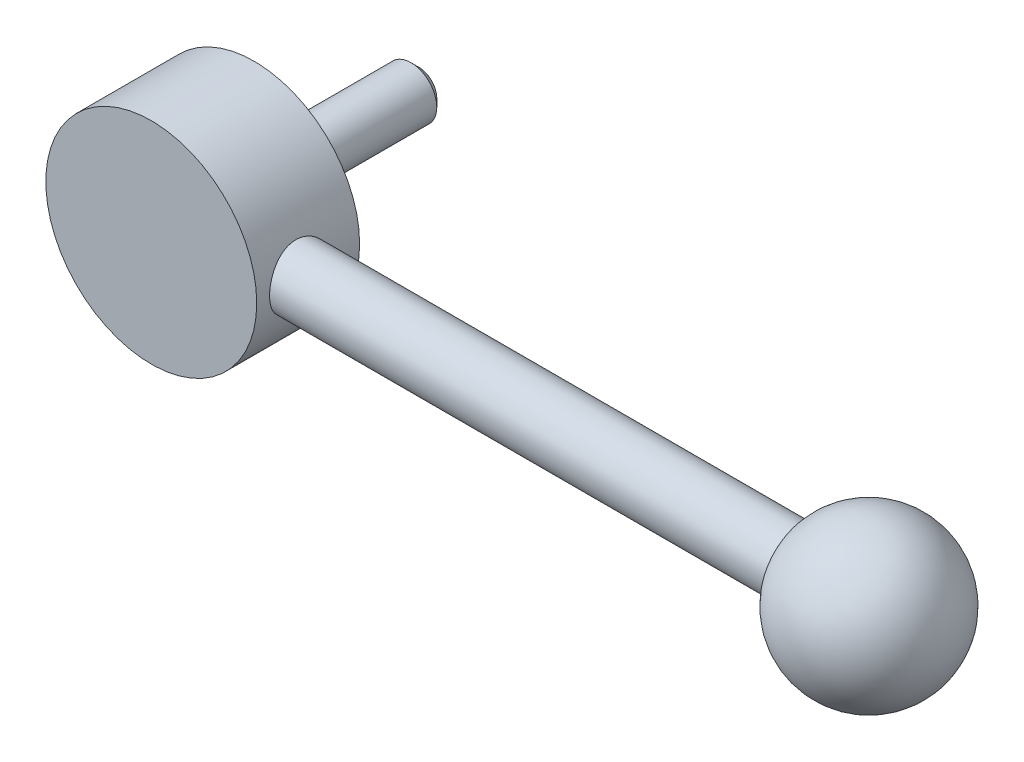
ISO-10303-21;
HEADER;
FILE_DESCRIPTION(('STEP AP214'),'2;1');
FILE_NAME('part.step','',(''),(''),'','','');
FILE_SCHEMA(('AUTOMOTIVE_DESIGN { 1 0 10303 214 1 1 1 1 }'));
ENDSEC;
DATA;
#1=APPLICATION_CONTEXT('core data for automotive mechanical design processes');
#2=APPLICATION_PROTOCOL_DEFINITION('international standard','automotive_design',2000,#1);
#3=PRODUCT_CONTEXT('',#1,'mechanical');
#4=PRODUCT('Part','Part','',(#3));
#5=PRODUCT_RELATED_PRODUCT_CATEGORY('part','',(#4));
#6=PRODUCT_DEFINITION_FORMATION('','',#4);
#7=PRODUCT_DEFINITION_CONTEXT('part definition',#1,'design');
#8=PRODUCT_DEFINITION('design','',#6,#7);
#9=PRODUCT_DEFINITION_SHAPE('','',#8);
#10=(LENGTH_UNIT() NAMED_UNIT(*) SI_UNIT(.MILLI.,.METRE.));
#11=(NAMED_UNIT(*) PLANE_ANGLE_UNIT() SI_UNIT($,.RADIAN.));
#12=(NAMED_UNIT(*) SI_UNIT($,.STERADIAN.) SOLID_ANGLE_UNIT());
#13=UNCERTAINTY_MEASURE_WITH_UNIT(LENGTH_MEASURE(1.E-05),#10,'distance_accuracy_value','');
#14=(GEOMETRIC_REPRESENTATION_CONTEXT(3) GLOBAL_UNCERTAINTY_ASSIGNED_CONTEXT((#13)) GLOBAL_UNIT_ASSIGNED_CONTEXT((#10,
#11,#12)) REPRESENTATION_CONTEXT('',''));
#15=CARTESIAN_POINT('',(0.,0.,0.));
#16=DIRECTION('',(0.,0.,1.));
#17=DIRECTION('',(1.,0.,0.));
#18=AXIS2_PLACEMENT_3D('',#15,#16,#17);
#19=CARTESIAN_POINT('',(0.,0.,40.));
#20=DIRECTION('',(0.,0.,1.));
#21=DIRECTION('',(1.,0.,0.));
#22=AXIS2_PLACEMENT_3D('',#19,#20,#21);
#23=CYLINDRICAL_SURFACE('',#22,9.5);
#24=CARTESIAN_POINT('',(0.,0.,2.));
#25=DIRECTION('',(0.,0.,1.));
#26=DIRECTION('',(1.,0.,0.));
#27=AXIS2_PLACEMENT_3D('',#24,#25,#26);
#28=CIRCLE('',#27,9.5);
#29=CARTESIAN_POINT('',(9.5,0.,2.));
#30=VERTEX_POINT('',#29);
#31=EDGE_CURVE('E37',#30,#30,#28,.T.);
#32=ORIENTED_EDGE('',*,*,#31,.F.);
#33=EDGE_LOOP('',(#32));
#34=FACE_BOUND('',#33,.T.);
#35=CARTESIAN_POINT('',(0.,0.,0.));
#36=DIRECTION('',(0.,0.,1.));
#37=DIRECTION('',(1.,0.,0.));
#38=AXIS2_PLACEMENT_3D('',#35,#36,#37);
#39=CIRCLE('',#38,9.5);
#40=CARTESIAN_POINT('',(9.5,0.,0.));
#41=VERTEX_POINT('',#40);
#42=EDGE_CURVE('E23',#41,#41,#39,.T.);
#43=ORIENTED_EDGE('',*,*,#42,.T.);
#44=EDGE_LOOP('',(#43));
#45=FACE_BOUND('',#44,.T.);
#46=ADVANCED_FACE('F12',(#34,#45),#23,.T.);
#47=CARTESIAN_POINT('',(5.,0.,0.));
#48=DIRECTION('',(0.,0.,1.));
#49=DIRECTION('',(1.,0.,0.));
#50=AXIS2_PLACEMENT_3D('',#47,#48,#49);
#51=PLANE('',#50);
#52=ORIENTED_EDGE('',*,*,#42,.F.);
#53=EDGE_LOOP('',(#52));
#54=FACE_BOUND('',#53,.T.);
#55=CARTESIAN_POINT('',(0.,0.,0.));
#56=DIRECTION('',(0.,0.,1.));
#57=DIRECTION('',(1.,0.,0.));
#58=AXIS2_PLACEMENT_3D('',#55,#56,#57);
#59=CIRCLE('',#58,5.);
#60=CARTESIAN_POINT('',(5.,0.,0.));
#61=VERTEX_POINT('',#60);
#62=EDGE_CURVE('E27',#61,#61,#59,.T.);
#63=ORIENTED_EDGE('',*,*,#62,.T.);
#64=EDGE_LOOP('',(#63));
#65=FACE_BOUND('',#64,.T.);
#66=ADVANCED_FACE('F63',(#54,#65),#51,.F.);
#67=CARTESIAN_POINT('',(0.,0.,40.));
#68=DIRECTION('',(0.,0.,1.));
#69=DIRECTION('',(1.,0.,0.));
#70=AXIS2_PLACEMENT_3D('',#67,#68,#69);
#71=CYLINDRICAL_SURFACE('',#70,5.);
#72=CARTESIAN_POINT('',(0.,0.,-28.5));
#73=DIRECTION('',(0.,0.,-1.));
#74=DIRECTION('',(-1.,0.,0.));
#75=AXIS2_PLACEMENT_3D('',#72,#73,#74);
#76=CIRCLE('',#75,5.);
#77=CARTESIAN_POINT('',(-5.,0.,-28.5));
#78=VERTEX_POINT('',#77);
#79=EDGE_CURVE('E19',#78,#78,#76,.F.);
#80=ORIENTED_EDGE('',*,*,#79,.T.);
#81=EDGE_LOOP('',(#80));
#82=FACE_BOUND('',#81,.T.);
#83=ORIENTED_EDGE('',*,*,#62,.F.);
#84=EDGE_LOOP('',(#83));
#85=FACE_BOUND('',#84,.T.);
#86=ADVANCED_FACE('F69',(#82,#85),#71,.T.);
#87=CARTESIAN_POINT('',(5.,0.,-30.));
#88=DIRECTION('',(0.,0.,-1.));
#89=DIRECTION('',(-1.,0.,0.));
#90=AXIS2_PLACEMENT_3D('',#87,#88,#89);
#91=PLANE('',#90);
#92=CARTESIAN_POINT('',(0.,0.,-30.));
#93=DIRECTION('',(0.,0.,-1.));
#94=DIRECTION('',(-1.,0.,0.));
#95=AXIS2_PLACEMENT_3D('',#92,#93,#94);
#96=CIRCLE('',#95,3.5);
#97=CARTESIAN_POINT('',(-3.5,0.,-30.));
#98=VERTEX_POINT('',#97);
#99=EDGE_CURVE('E8',#98,#98,#96,.T.);
#100=ORIENTED_EDGE('',*,*,#99,.T.);
#101=EDGE_LOOP('',(#100));
#102=FACE_BOUND('',#101,.T.);
#103=ADVANCED_FACE('F77',(#102),#91,.T.);
#104=CARTESIAN_POINT('',(20.5,0.,22.));
#105=DIRECTION('',(0.,0.,-1.));
#106=DIRECTION('',(-1.,0.,0.));
#107=AXIS2_PLACEMENT_3D('',#104,#105,#106);
#108=PLANE('',#107);
#109=CARTESIAN_POINT('',(0.,0.,22.));
#110=DIRECTION('',(0.,0.,1.));
#111=DIRECTION('',(1.,0.,0.));
#112=AXIS2_PLACEMENT_3D('',#109,#110,#111);
#113=CIRCLE('',#112,20.5);
#114=CARTESIAN_POINT('',(20.5,0.,22.));
#115=VERTEX_POINT('',#114);
#116=EDGE_CURVE('E86',#115,#115,#113,.T.);
#117=ORIENTED_EDGE('',*,*,#116,.T.);
#118=EDGE_LOOP('',(#117));
#119=FACE_BOUND('',#118,.T.);
#120=ADVANCED_FACE('F58',(#119),#108,.F.);
#121=CARTESIAN_POINT('',(0.,0.,40.));
#122=DIRECTION('',(0.,0.,1.));
#123=DIRECTION('',(1.,0.,0.));
#124=AXIS2_PLACEMENT_3D('',#121,#122,#123);
#125=CYLINDRICAL_SURFACE('',#124,20.5);
#126=CARTESIAN_POINT('',(20.5,0.,7.5));
#127=CARTESIAN_POINT('',(20.4999997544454,-0.164768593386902,7.50000038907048));
#128=CARTESIAN_POINT('',(20.4980087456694,-0.329544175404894,7.50679278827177));
#129=CARTESIAN_POINT('',(20.4900990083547,-0.65788822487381,7.5339021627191));
#130=CARTESIAN_POINT('',(20.4841800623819,-0.821456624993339,7.55421988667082));
#131=CARTESIAN_POINT('',(20.4685766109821,-1.1462122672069,7.60820100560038));
#132=CARTESIAN_POINT('',(20.4588916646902,-1.30739922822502,7.64186596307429));
#133=CARTESIAN_POINT('',(20.4360164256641,-1.62628314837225,7.72226244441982));
#134=CARTESIAN_POINT('',(20.4228249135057,-1.7839788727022,7.76899851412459));
#135=CARTESIAN_POINT('',(20.3933182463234,-2.09448185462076,7.87505403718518));
#136=CARTESIAN_POINT('',(20.3770082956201,-2.24729676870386,7.93435254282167));
#137=CARTESIAN_POINT('',(20.3416823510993,-2.54730770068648,8.06511256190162));
#138=CARTESIAN_POINT('',(20.3226662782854,-2.69450355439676,8.13657443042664));
#139=CARTESIAN_POINT('',(20.2824208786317,-2.98237032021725,8.2911456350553));
#140=CARTESIAN_POINT('',(20.2611910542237,-3.123039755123,8.37425759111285));
#141=CARTESIAN_POINT('',(20.2170775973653,-3.39691169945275,8.55150630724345));
#142=CARTESIAN_POINT('',(20.1941944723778,-3.53011647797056,8.6456396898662));
#143=CARTESIAN_POINT('',(20.146767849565,-3.79154794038,8.84682399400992));
#144=CARTESIAN_POINT('',(20.1221971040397,-3.91956600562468,8.95413966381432));
#145=CARTESIAN_POINT('',(20.0725990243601,-4.1661228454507,9.17897611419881));
#146=CARTESIAN_POINT('',(20.0475718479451,-4.2846648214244,9.29649342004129));
#147=CARTESIAN_POINT('',(19.9977175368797,-4.5116297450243,9.54108035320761));
#148=CARTESIAN_POINT('',(19.9728905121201,-4.62004743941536,9.66815487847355));
#149=CARTESIAN_POINT('',(19.9241410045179,-4.82595045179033,9.93095842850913));
#150=CARTESIAN_POINT('',(19.9002181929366,-4.92343976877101,10.0666842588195));
#151=CARTESIAN_POINT('',(19.8534354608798,-5.10885934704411,10.3490171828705));
#152=CARTESIAN_POINT('',(19.8306098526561,-5.19653638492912,10.4957964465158));
#153=CARTESIAN_POINT('',(19.7872868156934,-5.35913808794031,10.7965125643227));
#154=CARTESIAN_POINT('',(19.766788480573,-5.43406772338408,10.9504465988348));
#155=CARTESIAN_POINT('',(19.7287391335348,-5.57062666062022,11.2645036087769));
#156=CARTESIAN_POINT('',(19.7111887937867,-5.63225293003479,11.4246279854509));
#157=CARTESIAN_POINT('',(19.6796082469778,-5.74162541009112,11.7498143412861));
#158=CARTESIAN_POINT('',(19.6655765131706,-5.78937764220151,11.9148741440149));
#159=CARTESIAN_POINT('',(19.6418018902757,-5.86952471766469,12.2443484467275));
#160=CARTESIAN_POINT('',(19.6319555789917,-5.90229162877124,12.4086649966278));
#161=CARTESIAN_POINT('',(19.6163432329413,-5.95397424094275,12.7395899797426));
#162=CARTESIAN_POINT('',(19.6105755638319,-5.97289549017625,12.9061974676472));
#163=CARTESIAN_POINT('',(19.603301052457,-5.99672775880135,13.2405034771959));
#164=CARTESIAN_POINT('',(19.6017941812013,-6.00163887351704,13.4082019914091));
#165=CARTESIAN_POINT('',(19.6030905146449,-5.99740342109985,13.7434027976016));
#166=CARTESIAN_POINT('',(19.6058936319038,-5.98825713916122,13.9109050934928));
#167=CARTESIAN_POINT('',(19.6155486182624,-5.95655212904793,14.238688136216));
#168=CARTESIAN_POINT('',(19.6222578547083,-5.9344657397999,14.3990190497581));
#169=CARTESIAN_POINT('',(19.6394095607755,-5.87745500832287,14.7172343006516));
#170=CARTESIAN_POINT('',(19.649853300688,-5.84252629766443,14.8751177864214));
#171=CARTESIAN_POINT('',(19.6741615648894,-5.7601395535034,15.187257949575));
#172=CARTESIAN_POINT('',(19.688025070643,-5.71268525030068,15.3415156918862));
#173=CARTESIAN_POINT('',(19.7187796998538,-5.60560692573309,15.6454959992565));
#174=CARTESIAN_POINT('',(19.7356719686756,-5.5459782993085,15.7952168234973));
#175=CARTESIAN_POINT('',(19.7722410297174,-5.41416819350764,16.0910079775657));
#176=CARTESIAN_POINT('',(19.7919506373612,-5.34183608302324,16.2370072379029));
#177=CARTESIAN_POINT('',(19.8334359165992,-5.18568691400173,16.5224423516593));
#178=CARTESIAN_POINT('',(19.8552123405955,-5.10186566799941,16.6618757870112));
#179=CARTESIAN_POINT('',(19.9227548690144,-4.8340177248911,17.0689782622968));
#180=CARTESIAN_POINT('',(19.9707648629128,-4.63350124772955,17.3256854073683));
#181=CARTESIAN_POINT('',(20.0696162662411,-4.18511260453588,17.8126329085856));
#182=CARTESIAN_POINT('',(20.1204944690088,-3.93567819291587,18.0414205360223));
#183=CARTESIAN_POINT('',(20.2176813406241,-3.40132203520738,18.4542852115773));
#184=CARTESIAN_POINT('',(20.2639897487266,-3.11639826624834,18.63835970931));
#185=CARTESIAN_POINT('',(20.3472018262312,-2.51664006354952,18.9573414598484));
#186=CARTESIAN_POINT('',(20.3840462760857,-2.2016334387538,19.0919412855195));
#187=CARTESIAN_POINT('',(20.4437541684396,-1.55212614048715,19.3058343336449));
#188=CARTESIAN_POINT('',(20.4666213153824,-1.21763065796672,19.3851422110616));
#189=CARTESIAN_POINT('',(20.4952175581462,-0.550953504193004,19.4838192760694));
#190=CARTESIAN_POINT('',(20.5015074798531,-0.219085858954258,19.5051506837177));
#191=CARTESIAN_POINT('',(20.4978783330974,0.44350281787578,19.4927506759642));
#192=CARTESIAN_POINT('',(20.4879613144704,0.774223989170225,19.4590262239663));
#193=CARTESIAN_POINT('',(20.4533992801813,1.41781519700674,19.3390673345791));
#194=CARTESIAN_POINT('',(20.4290727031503,1.73091547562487,19.253967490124));
#195=CARTESIAN_POINT('',(20.3684901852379,2.33834273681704,19.0350155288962));
#196=CARTESIAN_POINT('',(20.3322328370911,2.63266749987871,18.901157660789));
#197=CARTESIAN_POINT('',(20.2505580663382,3.201467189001,18.585163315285));
#198=CARTESIAN_POINT('',(20.2049537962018,3.47535043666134,18.4020133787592));
#199=CARTESIAN_POINT('',(20.1098009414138,3.98926947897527,17.9937010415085));
#200=CARTESIAN_POINT('',(20.0602514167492,4.22929716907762,17.7685286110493));
#201=CARTESIAN_POINT('',(19.9860369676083,4.56311282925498,17.3996018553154));
#202=CARTESIAN_POINT('',(19.9608943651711,4.67160496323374,17.2689475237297));
#203=CARTESIAN_POINT('',(19.9116554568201,4.87720494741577,16.9988051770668));
#204=CARTESIAN_POINT('',(19.8875587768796,4.97431688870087,16.8593203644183));
#205=CARTESIAN_POINT('',(19.8411019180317,5.15650338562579,16.5723575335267));
#206=CARTESIAN_POINT('',(19.8187424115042,5.24157329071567,16.4248764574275));
#207=CARTESIAN_POINT('',(19.7764458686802,5.39896546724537,16.1230001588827));
#208=CARTESIAN_POINT('',(19.7565078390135,5.47129297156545,15.9686078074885));
#209=CARTESIAN_POINT('',(19.7197444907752,5.60234699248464,15.6546484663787));
#210=CARTESIAN_POINT('',(19.7029051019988,5.6611353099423,15.49510893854));
#211=CARTESIAN_POINT('',(19.6727610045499,5.76501533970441,15.1713718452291));
#212=CARTESIAN_POINT('',(19.6594548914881,5.81011249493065,15.0071761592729));
#213=CARTESIAN_POINT('',(19.6367999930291,5.88622676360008,14.675294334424));
#214=CARTESIAN_POINT('',(19.6274509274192,5.91724487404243,14.5076084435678));
#215=CARTESIAN_POINT('',(19.6130187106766,5.96490739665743,14.1700260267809));
#216=CARTESIAN_POINT('',(19.6079354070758,5.98155232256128,14.0001295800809));
#217=CARTESIAN_POINT('',(19.6023186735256,5.9999323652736,13.6662567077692));
#218=CARTESIAN_POINT('',(19.6016119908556,6.00223524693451,13.5023141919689));
#219=CARTESIAN_POINT('',(19.6043094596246,5.99341910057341,13.1747666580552));
#220=CARTESIAN_POINT('',(19.6077150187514,5.98229547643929,13.0111617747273));
#221=CARTESIAN_POINT('',(19.6185313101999,5.94672790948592,12.6856110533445));
#222=CARTESIAN_POINT('',(19.6259403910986,5.92228945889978,12.5236645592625));
#223=CARTESIAN_POINT('',(19.6445384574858,5.86030325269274,12.2024601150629));
#224=CARTESIAN_POINT('',(19.6557288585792,5.82275058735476,12.0432031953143));
#225=CARTESIAN_POINT('',(19.6814005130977,5.73537439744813,11.7303823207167));
#226=CARTESIAN_POINT('',(19.6958418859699,5.68569901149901,11.5767736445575));
#227=CARTESIAN_POINT('',(19.7276768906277,5.57423736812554,11.2742707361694));
#228=CARTESIAN_POINT('',(19.7450715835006,5.51244675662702,11.125378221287));
#229=CARTESIAN_POINT('',(19.782319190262,5.37724463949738,10.8333301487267));
#230=CARTESIAN_POINT('',(19.802171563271,5.30383568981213,10.6901733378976));
#231=CARTESIAN_POINT('',(19.8438063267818,5.14587421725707,10.4103722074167));
#232=CARTESIAN_POINT('',(19.8655894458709,5.061317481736,10.2737303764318));
#233=CARTESIAN_POINT('',(19.9112797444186,4.87853600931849,10.0032239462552));
#234=CARTESIAN_POINT('',(19.9352342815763,4.77994030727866,9.86961789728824));
#235=CARTESIAN_POINT('',(19.9839347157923,4.57206196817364,9.61107007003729));
#236=CARTESIAN_POINT('',(20.0086809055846,4.46277534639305,9.48613155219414));
#237=CARTESIAN_POINT('',(20.0582834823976,4.23425660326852,9.24575891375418));
#238=CARTESIAN_POINT('',(20.0831398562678,4.11502564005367,9.13032368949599));
#239=CARTESIAN_POINT('',(20.1323098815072,3.86730499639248,8.90963180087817));
#240=CARTESIAN_POINT('',(20.1566233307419,3.7388119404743,8.80437888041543));
#241=CARTESIAN_POINT('',(20.2046974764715,3.46977987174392,8.6020699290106));
#242=CARTESIAN_POINT('',(20.2284250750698,3.32900807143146,8.50531528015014));
#243=CARTESIAN_POINT('',(20.2739466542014,3.03949915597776,8.32403500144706));
#244=CARTESIAN_POINT('',(20.2957406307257,2.8907620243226,8.23950939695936));
#245=CARTESIAN_POINT('',(20.3367679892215,2.58639447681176,8.0833769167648));
#246=CARTESIAN_POINT('',(20.356002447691,2.43076699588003,8.01176460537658));
#247=CARTESIAN_POINT('',(20.3913677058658,2.11366097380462,7.88201306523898));
#248=CARTESIAN_POINT('',(20.4074988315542,1.95218304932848,7.82387242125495));
#249=CARTESIAN_POINT('',(20.4344672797,1.64423058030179,7.72771145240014));
#250=CARTESIAN_POINT('',(20.4457076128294,1.49828162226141,7.68811373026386));
#251=CARTESIAN_POINT('',(20.4651675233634,1.2036242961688,7.62002138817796));
#252=CARTESIAN_POINT('',(20.4733873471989,1.0549161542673,7.59152586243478));
#253=CARTESIAN_POINT('',(20.4866168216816,0.755624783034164,7.54584620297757));
#254=CARTESIAN_POINT('',(20.491626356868,0.605041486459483,7.52866247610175));
#255=CARTESIAN_POINT('',(20.49831762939,0.302973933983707,7.50574067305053));
#256=CARTESIAN_POINT('',(20.5000002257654,0.151489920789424,7.49999964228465));
#257=CARTESIAN_POINT('',(20.5,0.,7.5));
#258=B_SPLINE_CURVE_WITH_KNOTS('',3,(#126,#127,#128,#129,#130,#131,#132,#133,#134,#135,#136,
#137,#138,#139,#140,#141,#142,#143,#144,#145,#146,#147,#148,#149,#150,#151,#152,#153,#154,#155,
#156,#157,#158,#159,#160,#161,#162,#163,#164,#165,#166,#167,#168,#169,#170,#171,#172,#173,#174,
#175,#176,#177,#178,#179,#180,#181,#182,#183,#184,#185,#186,#187,#188,#189,#190,#191,#192,#193,
#194,#195,#196,#197,#198,#199,#200,#201,#202,#203,#204,#205,#206,#207,#208,#209,#210,#211,#212,
#213,#214,#215,#216,#217,#218,#219,#220,#221,#222,#223,#224,#225,#226,#227,#228,#229,#230,#231,
#232,#233,#234,#235,#236,#237,#238,#239,#240,#241,#242,#243,#244,#245,#246,#247,#248,#249,#250,
#251,#252,#253,#254,#255,#256,#257),.UNSPECIFIED.,.T.,.F.,(4,2,2,2,2,2,2,2,2,2,2,2,2,2,2,2,2,2,
2,2,2,2,2,2,2,2,2,2,2,2,2,2,2,2,2,2,2,2,2,2,2,2,2,2,2,2,2,2,2,2,2,2,2,2,2,2,2,2,2,2,2,2,2,2,2,
4),(0.,0.494166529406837,0.988360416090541,1.48261217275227,1.97703603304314,2.47064184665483,
2.96426207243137,3.45799348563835,3.95157399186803,4.45753270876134,4.96331976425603,
5.46936781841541,5.97523008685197,6.49206535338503,7.00869863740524,7.52544955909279,
8.04197586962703,8.54486934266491,9.04756118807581,9.55024961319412,10.0529278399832,
10.5383093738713,11.0238561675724,11.5092585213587,11.9948448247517,12.4866344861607,
12.9786038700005,13.9617709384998,14.9839152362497,16.006117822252,17.0345689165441,
18.062747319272,19.0556662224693,20.0484595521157,21.0200911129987,21.9918373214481,
22.9853318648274,23.97906383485,24.4935931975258,25.0079370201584,25.5224789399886,
26.0368090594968,26.5487427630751,27.0604726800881,27.5721663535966,28.0838417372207,
28.5751252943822,29.066577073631,29.5578262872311,30.0492596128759,30.5349645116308,
31.0208442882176,31.5066173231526,31.9925744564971,32.4953010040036,32.9982156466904,
33.5010718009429,34.0041121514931,34.5208552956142,35.0375995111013,35.5541256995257,
36.0705976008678,36.525077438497,36.9795201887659,37.4339792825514,37.8883210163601),.UNSPECIFIED.);
#259=CARTESIAN_POINT('',(20.5,0.,7.5));
#260=VERTEX_POINT('',#259);
#261=EDGE_CURVE('E30',#260,#260,#258,.T.);
#262=ORIENTED_EDGE('',*,*,#261,.T.);
#263=EDGE_LOOP('',(#262));
#264=FACE_BOUND('',#263,.T.);
#265=ORIENTED_EDGE('',*,*,#116,.F.);
#266=EDGE_LOOP('',(#265));
#267=FACE_BOUND('',#266,.T.);
#268=CARTESIAN_POINT('',(0.,0.,2.));
#269=DIRECTION('',(0.,0.,1.));
#270=DIRECTION('',(1.,0.,0.));
#271=AXIS2_PLACEMENT_3D('',#268,#269,#270);
#272=CIRCLE('',#271,20.5);
#273=CARTESIAN_POINT('',(20.5,0.,2.));
#274=VERTEX_POINT('',#273);
#275=EDGE_CURVE('E88',#274,#274,#272,.T.);
#276=ORIENTED_EDGE('',*,*,#275,.T.);
#277=EDGE_LOOP('',(#276));
#278=FACE_BOUND('',#277,.T.);
#279=ADVANCED_FACE('F40',(#264,#267,#278),#125,.T.);
#280=CARTESIAN_POINT('',(9.5,0.,2.));
#281=DIRECTION('',(0.,0.,1.));
#282=DIRECTION('',(1.,0.,0.));
#283=AXIS2_PLACEMENT_3D('',#280,#281,#282);
#284=PLANE('',#283);
#285=ORIENTED_EDGE('',*,*,#275,.F.);
#286=EDGE_LOOP('',(#285));
#287=FACE_BOUND('',#286,.T.);
#288=ORIENTED_EDGE('',*,*,#31,.T.);
#289=EDGE_LOOP('',(#288));
#290=FACE_BOUND('',#289,.T.);
#291=ADVANCED_FACE('F49',(#287,#290),#284,.F.);
#292=CARTESIAN_POINT('',(-30.,0.,13.5));
#293=DIRECTION('',(-1.,0.,0.));
#294=DIRECTION('',(0.,0.,1.));
#295=AXIS2_PLACEMENT_3D('',#292,#293,#294);
#296=CYLINDRICAL_SURFACE('',#295,6.);
#297=CARTESIAN_POINT('',(117.252272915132,0.,13.5));
#298=DIRECTION('',(-1.,0.,0.));
#299=DIRECTION('',(0.,0.,1.));
#300=AXIS2_PLACEMENT_3D('',#297,#298,#299);
#301=CIRCLE('',#300,6.);
#302=CARTESIAN_POINT('',(117.252272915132,0.,19.5));
#303=VERTEX_POINT('',#302);
#304=EDGE_CURVE('E38',#303,#303,#301,.T.);
#305=ORIENTED_EDGE('',*,*,#304,.T.);
#306=EDGE_LOOP('',(#305));
#307=FACE_BOUND('',#306,.T.);
#308=ORIENTED_EDGE('',*,*,#261,.F.);
#309=EDGE_LOOP('',(#308));
#310=FACE_BOUND('',#309,.T.);
#311=ADVANCED_FACE('F44',(#307,#310),#296,.T.);
#312=CARTESIAN_POINT('',(131.,0.,13.5));
#313=DIRECTION('',(0.,0.,1.));
#314=DIRECTION('',(1.,0.,0.));
#315=AXIS2_PLACEMENT_3D('',#312,#313,#314);
#316=SPHERICAL_SURFACE('',#315,15.);
#317=CARTESIAN_POINT('',(131.,0.,13.5));
#318=DIRECTION('',(-1.,0.,0.));
#319=DIRECTION('',(0.,0.,1.));
#320=AXIS2_PLACEMENT_3D('',#317,#318,#319);
#321=SPHERICAL_SURFACE('',#320,15.);
#322=ORIENTED_EDGE('',*,*,#304,.F.);
#323=EDGE_LOOP('',(#322));
#324=FACE_BOUND('',#323,.T.);
#325=ADVANCED_FACE('F48',(#324),#321,.T.);
#326=CARTESIAN_POINT('',(0.,0.,-28.5));
#327=DIRECTION('',(0.,0.,1.));
#328=DIRECTION('',(1.,0.,0.));
#329=AXIS2_PLACEMENT_3D('',#326,#327,#328);
#330=CONICAL_SURFACE('',#329,5.,0.785398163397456);
#331=ORIENTED_EDGE('',*,*,#99,.F.);
#332=EDGE_LOOP('',(#331));
#333=FACE_BOUND('',#332,.T.);
#334=ORIENTED_EDGE('',*,*,#79,.F.);
#335=EDGE_LOOP('',(#334));
#336=FACE_BOUND('',#335,.T.);
#337=ADVANCED_FACE('F14',(#333,#336),#330,.T.);
#338=CLOSED_SHELL('',(#46,#66,#86,#103,#120,#279,#291,#311,#325,#337));
#339=MANIFOLD_SOLID_BREP('B1',#338);
#340=ADVANCED_BREP_SHAPE_REPRESENTATION('',(#18,#339),#14);
#341=SHAPE_DEFINITION_REPRESENTATION(#9,#340);
ENDSEC;
END-ISO-10303-21;
